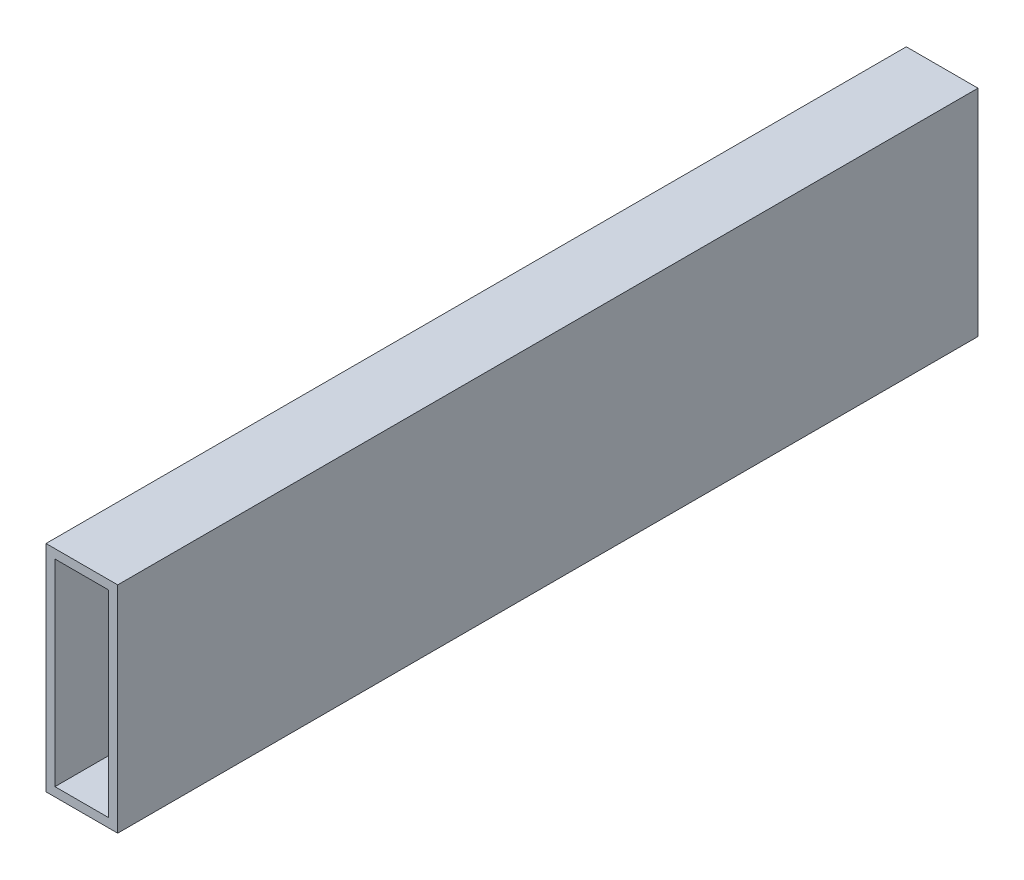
from build123d import *

# Parameters (mm, degrees)
SKETCH1_W          = 25.4
SKETCH1_H          = 76.2
SKETCH1_W_2        = 19.05
SKETCH1_H_2        = 69.85
BASE_EXTRUDE_DEPTH = 304.8


with BuildPart() as part:
    # Sketch1 → Base-Extrude (new body)
    with BuildSketch(Plane.XY):
        with Locations((12.7, 38.1)):
            Rectangle(SKETCH1_W, SKETCH1_H)
        with Locations((12.7, 38.1)):
            Rectangle(SKETCH1_W_2, SKETCH1_H_2, mode=Mode.SUBTRACT)
    extrude(amount=BASE_EXTRUDE_DEPTH)


solid = part.part
